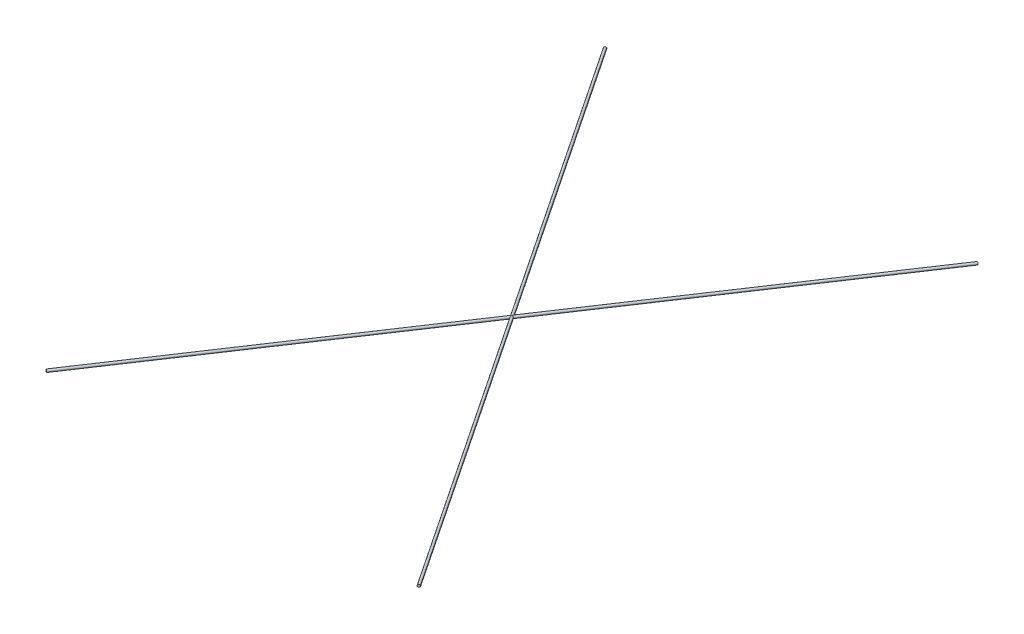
from build123d import *

# Parameters (mm, degrees)
SKETCH3_R = 5
SKETCH4_R = 5


with BuildPart() as part:
    # Sweep1: sweep along a path in Sketch2
    with BuildLine(Plane(origin=(0, 0, 0), x_dir=(1, 0, 0), z_dir=(0, 1, 0))) as sweep1_path:
        Line((722.648270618, -1083.975173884), (-722.648270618, 1083.975173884))
    # Sketch3 → Sweep1 (sweep)
    with BuildSketch(Plane(origin=(722.648270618, 0, 1083.975173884), x_dir=(-0.8320509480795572, 0, 0.5546992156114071), z_dir=(-0.554699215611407, 0, -0.832050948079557))):
        Circle(SKETCH3_R)
    sweep(path=sweep1_path.line)

    # Sweep2: sweep along a path in Sketch1
    with BuildLine(Plane(origin=(0, 0, 0), x_dir=(1, 0, 0), z_dir=(0, 1, 0))) as sweep2_path:
        Line((-722.648270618, -1083.975173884), (722.648270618, 1083.975173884))
    # Sketch4 → Sweep2 (sweep)
    with BuildSketch(Plane(origin=(722.648270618, 0, -1083.975173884), x_dir=(-0.8320509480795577, 0, -0.5546992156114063), z_dir=(0.5546992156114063, 0, -0.8320509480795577))):
        Circle(SKETCH4_R)
    sweep(path=sweep2_path.line)


solid = part.part
